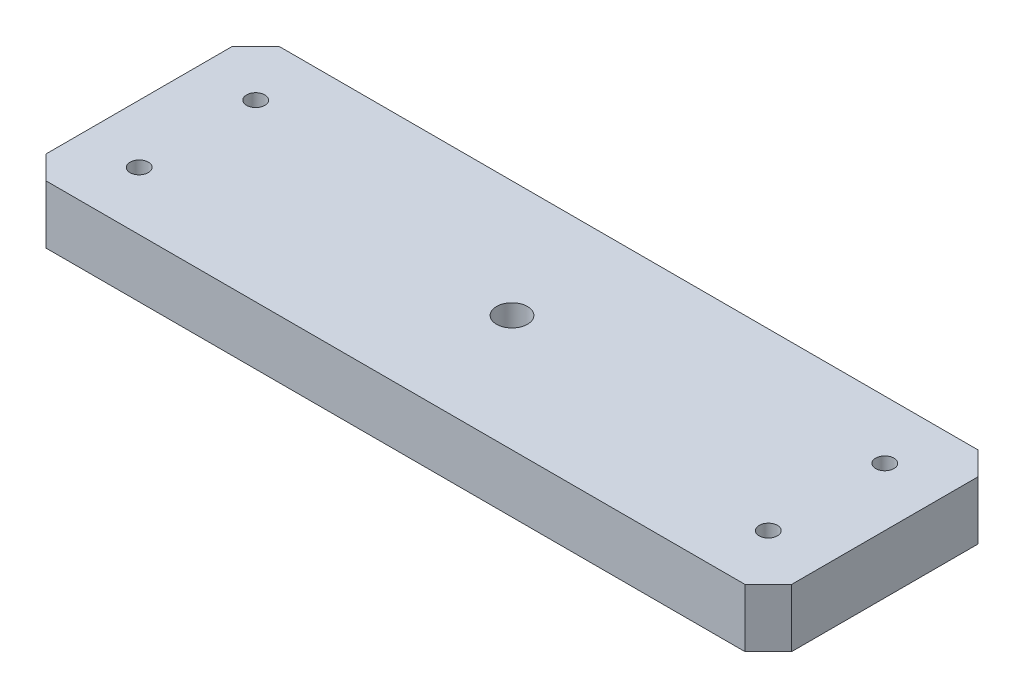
ISO-10303-21;
HEADER;
FILE_DESCRIPTION(('STEP AP214'),'2;1');
FILE_NAME('part.step','',(''),(''),'','','');
FILE_SCHEMA(('AUTOMOTIVE_DESIGN { 1 0 10303 214 1 1 1 1 }'));
ENDSEC;
DATA;
#1=APPLICATION_CONTEXT('core data for automotive mechanical design processes');
#2=APPLICATION_PROTOCOL_DEFINITION('international standard','automotive_design',2000,#1);
#3=PRODUCT_CONTEXT('',#1,'mechanical');
#4=PRODUCT('Part','Part','',(#3));
#5=PRODUCT_RELATED_PRODUCT_CATEGORY('part','',(#4));
#6=PRODUCT_DEFINITION_FORMATION('','',#4);
#7=PRODUCT_DEFINITION_CONTEXT('part definition',#1,'design');
#8=PRODUCT_DEFINITION('design','',#6,#7);
#9=PRODUCT_DEFINITION_SHAPE('','',#8);
#10=(LENGTH_UNIT() NAMED_UNIT(*) SI_UNIT(.MILLI.,.METRE.));
#11=(NAMED_UNIT(*) PLANE_ANGLE_UNIT() SI_UNIT($,.RADIAN.));
#12=(NAMED_UNIT(*) SI_UNIT($,.STERADIAN.) SOLID_ANGLE_UNIT());
#13=UNCERTAINTY_MEASURE_WITH_UNIT(LENGTH_MEASURE(1.E-05),#10,'distance_accuracy_value','');
#14=(GEOMETRIC_REPRESENTATION_CONTEXT(3) GLOBAL_UNCERTAINTY_ASSIGNED_CONTEXT((#13)) GLOBAL_UNIT_ASSIGNED_CONTEXT((#10,
#11,#12)) REPRESENTATION_CONTEXT('',''));
#15=CARTESIAN_POINT('',(0.,0.,0.));
#16=DIRECTION('',(0.,0.,1.));
#17=DIRECTION('',(1.,0.,0.));
#18=AXIS2_PLACEMENT_3D('',#15,#16,#17);
#19=CARTESIAN_POINT('',(101.6,15.875,-31.75));
#20=DIRECTION('',(-1.,0.,0.));
#21=DIRECTION('',(0.,0.,1.));
#22=AXIS2_PLACEMENT_3D('',#19,#20,#21);
#23=PLANE('',#22);
#24=DIRECTION('',(0.,0.,-1.));
#25=VECTOR('',#24,1.);
#26=CARTESIAN_POINT('',(101.6,15.875,-31.75));
#27=LINE('',#26,#25);
#28=CARTESIAN_POINT('',(101.6,15.875,25.4));
#29=VERTEX_POINT('',#28);
#30=CARTESIAN_POINT('',(101.6,15.875,-25.4));
#31=VERTEX_POINT('',#30);
#32=EDGE_CURVE('E118',#29,#31,#27,.T.);
#33=ORIENTED_EDGE('',*,*,#32,.F.);
#34=DIRECTION('',(0.,-1.,0.));
#35=VECTOR('',#34,1.);
#36=CARTESIAN_POINT('',(101.6,15.875,25.4));
#37=LINE('',#36,#35);
#38=CARTESIAN_POINT('',(101.6,0.,25.4));
#39=VERTEX_POINT('',#38);
#40=EDGE_CURVE('E103',#29,#39,#37,.T.);
#41=ORIENTED_EDGE('',*,*,#40,.T.);
#42=DIRECTION('',(0.,0.,-1.));
#43=VECTOR('',#42,1.);
#44=CARTESIAN_POINT('',(101.6,0.,-31.75));
#45=LINE('',#44,#43);
#46=CARTESIAN_POINT('',(101.6,0.,-25.4));
#47=VERTEX_POINT('',#46);
#48=EDGE_CURVE('E115',#39,#47,#45,.T.);
#49=ORIENTED_EDGE('',*,*,#48,.T.);
#50=DIRECTION('',(0.,1.,0.));
#51=VECTOR('',#50,1.);
#52=CARTESIAN_POINT('',(101.6,15.875,-25.4));
#53=LINE('',#52,#51);
#54=EDGE_CURVE('E120',#47,#31,#53,.T.);
#55=ORIENTED_EDGE('',*,*,#54,.T.);
#56=EDGE_LOOP('',(#33,#41,#49,#55));
#57=FACE_BOUND('',#56,.T.);
#58=ADVANCED_FACE('F33',(#57),#23,.F.);
#59=CARTESIAN_POINT('',(-101.6,15.875,-31.75));
#60=DIRECTION('',(0.,0.,1.));
#61=DIRECTION('',(1.,0.,0.));
#62=AXIS2_PLACEMENT_3D('',#59,#60,#61);
#63=PLANE('',#62);
#64=DIRECTION('',(-1.,0.,0.));
#65=VECTOR('',#64,1.);
#66=CARTESIAN_POINT('',(-101.6,15.875,-31.75));
#67=LINE('',#66,#65);
#68=CARTESIAN_POINT('',(95.25,15.875,-31.75));
#69=VERTEX_POINT('',#68);
#70=CARTESIAN_POINT('',(-95.25,15.875,-31.75));
#71=VERTEX_POINT('',#70);
#72=EDGE_CURVE('E164',#69,#71,#67,.T.);
#73=ORIENTED_EDGE('',*,*,#72,.F.);
#74=DIRECTION('',(0.,-1.,0.));
#75=VECTOR('',#74,1.);
#76=CARTESIAN_POINT('',(95.25,15.875,-31.75));
#77=LINE('',#76,#75);
#78=CARTESIAN_POINT('',(95.25,0.,-31.75));
#79=VERTEX_POINT('',#78);
#80=EDGE_CURVE('E157',#69,#79,#77,.T.);
#81=ORIENTED_EDGE('',*,*,#80,.T.);
#82=DIRECTION('',(-1.,0.,0.));
#83=VECTOR('',#82,1.);
#84=CARTESIAN_POINT('',(-101.6,0.,-31.75));
#85=LINE('',#84,#83);
#86=CARTESIAN_POINT('',(-95.25,0.,-31.75));
#87=VERTEX_POINT('',#86);
#88=EDGE_CURVE('E124',#79,#87,#85,.T.);
#89=ORIENTED_EDGE('',*,*,#88,.T.);
#90=DIRECTION('',(0.,1.,0.));
#91=VECTOR('',#90,1.);
#92=CARTESIAN_POINT('',(-95.25,15.875,-31.75));
#93=LINE('',#92,#91);
#94=EDGE_CURVE('E155',#87,#71,#93,.T.);
#95=ORIENTED_EDGE('',*,*,#94,.T.);
#96=EDGE_LOOP('',(#73,#81,#89,#95));
#97=FACE_BOUND('',#96,.T.);
#98=ADVANCED_FACE('F162',(#97),#63,.F.);
#99=CARTESIAN_POINT('',(-101.6,15.875,-31.75));
#100=DIRECTION('',(1.,0.,0.));
#101=DIRECTION('',(0.,0.,-1.));
#102=AXIS2_PLACEMENT_3D('',#99,#100,#101);
#103=PLANE('',#102);
#104=DIRECTION('',(0.,0.,1.));
#105=VECTOR('',#104,1.);
#106=CARTESIAN_POINT('',(-101.6,15.875,-31.75));
#107=LINE('',#106,#105);
#108=CARTESIAN_POINT('',(-101.6,15.875,-25.4));
#109=VERTEX_POINT('',#108);
#110=CARTESIAN_POINT('',(-101.6,15.875,25.3999999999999));
#111=VERTEX_POINT('',#110);
#112=EDGE_CURVE('E172',#109,#111,#107,.T.);
#113=ORIENTED_EDGE('',*,*,#112,.F.);
#114=DIRECTION('',(0.,-1.,0.));
#115=VECTOR('',#114,1.);
#116=CARTESIAN_POINT('',(-101.6,15.875,-25.4));
#117=LINE('',#116,#115);
#118=CARTESIAN_POINT('',(-101.6,0.,-25.4));
#119=VERTEX_POINT('',#118);
#120=EDGE_CURVE('E11',#109,#119,#117,.T.);
#121=ORIENTED_EDGE('',*,*,#120,.T.);
#122=DIRECTION('',(0.,0.,1.));
#123=VECTOR('',#122,1.);
#124=CARTESIAN_POINT('',(-101.6,0.,-31.75));
#125=LINE('',#124,#123);
#126=CARTESIAN_POINT('',(-101.6,0.,25.3999999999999));
#127=VERTEX_POINT('',#126);
#128=EDGE_CURVE('E128',#119,#127,#125,.T.);
#129=ORIENTED_EDGE('',*,*,#128,.T.);
#130=DIRECTION('',(0.,1.,0.));
#131=VECTOR('',#130,1.);
#132=CARTESIAN_POINT('',(-101.6,15.875,25.3999999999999));
#133=LINE('',#132,#131);
#134=EDGE_CURVE('E41',#127,#111,#133,.T.);
#135=ORIENTED_EDGE('',*,*,#134,.T.);
#136=EDGE_LOOP('',(#113,#121,#129,#135));
#137=FACE_BOUND('',#136,.T.);
#138=ADVANCED_FACE('F171',(#137),#103,.F.);
#139=CARTESIAN_POINT('',(-101.6,15.875,31.75));
#140=DIRECTION('',(0.,0.,-1.));
#141=DIRECTION('',(-1.,0.,0.));
#142=AXIS2_PLACEMENT_3D('',#139,#140,#141);
#143=PLANE('',#142);
#144=DIRECTION('',(1.,0.,0.));
#145=VECTOR('',#144,1.);
#146=CARTESIAN_POINT('',(-101.6,0.,31.75));
#147=LINE('',#146,#145);
#148=CARTESIAN_POINT('',(-95.25,0.,31.75));
#149=VERTEX_POINT('',#148);
#150=CARTESIAN_POINT('',(95.25,0.,31.75));
#151=VERTEX_POINT('',#150);
#152=EDGE_CURVE('E138',#149,#151,#147,.T.);
#153=ORIENTED_EDGE('',*,*,#152,.T.);
#154=DIRECTION('',(0.,1.,0.));
#155=VECTOR('',#154,1.);
#156=CARTESIAN_POINT('',(95.25,15.875,31.75));
#157=LINE('',#156,#155);
#158=CARTESIAN_POINT('',(95.2499999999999,15.875,31.75));
#159=VERTEX_POINT('',#158);
#160=EDGE_CURVE('E104',#151,#159,#157,.T.);
#161=ORIENTED_EDGE('',*,*,#160,.T.);
#162=DIRECTION('',(1.,0.,0.));
#163=VECTOR('',#162,1.);
#164=CARTESIAN_POINT('',(-101.6,15.875,31.75));
#165=LINE('',#164,#163);
#166=CARTESIAN_POINT('',(-95.25,15.875,31.75));
#167=VERTEX_POINT('',#166);
#168=EDGE_CURVE('E134',#167,#159,#165,.T.);
#169=ORIENTED_EDGE('',*,*,#168,.F.);
#170=DIRECTION('',(0.,-1.,0.));
#171=VECTOR('',#170,1.);
#172=CARTESIAN_POINT('',(-95.25,15.875,31.75));
#173=LINE('',#172,#171);
#174=EDGE_CURVE('E109',#167,#149,#173,.T.);
#175=ORIENTED_EDGE('',*,*,#174,.T.);
#176=EDGE_LOOP('',(#153,#161,#169,#175));
#177=FACE_BOUND('',#176,.T.);
#178=ADVANCED_FACE('F233',(#177),#143,.F.);
#179=CARTESIAN_POINT('',(0.,15.875,0.));
#180=DIRECTION('',(0.,1.,0.));
#181=DIRECTION('',(0.,0.,1.));
#182=AXIS2_PLACEMENT_3D('',#179,#180,#181);
#183=PLANE('',#182);
#184=CARTESIAN_POINT('',(0.,15.875,0.));
#185=DIRECTION('',(0.,-1.,0.));
#186=DIRECTION('',(0.,0.,-1.));
#187=AXIS2_PLACEMENT_3D('',#184,#185,#186);
#188=CIRCLE('',#187,4.2164);
#189=CARTESIAN_POINT('',(0.,15.875,-4.2164));
#190=VERTEX_POINT('',#189);
#191=EDGE_CURVE('E198',#190,#190,#188,.T.);
#192=ORIENTED_EDGE('',*,*,#191,.T.);
#193=EDGE_LOOP('',(#192));
#194=FACE_BOUND('',#193,.T.);
#195=CARTESIAN_POINT('',(-85.725,15.875,-15.875));
#196=DIRECTION('',(0.,1.,0.));
#197=DIRECTION('',(0.,0.,1.));
#198=AXIS2_PLACEMENT_3D('',#195,#196,#197);
#199=CIRCLE('',#198,2.48919999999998);
#200=CARTESIAN_POINT('',(-85.725,15.875,-13.3858));
#201=VERTEX_POINT('',#200);
#202=EDGE_CURVE('E195',#201,#201,#199,.T.);
#203=ORIENTED_EDGE('',*,*,#202,.F.);
#204=EDGE_LOOP('',(#203));
#205=FACE_BOUND('',#204,.T.);
#206=CARTESIAN_POINT('',(85.725,15.875,-15.875));
#207=DIRECTION('',(0.,1.,0.));
#208=DIRECTION('',(0.,0.,1.));
#209=AXIS2_PLACEMENT_3D('',#206,#207,#208);
#210=CIRCLE('',#209,2.48919999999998);
#211=CARTESIAN_POINT('',(85.725,15.875,-13.3858));
#212=VERTEX_POINT('',#211);
#213=EDGE_CURVE('E189',#212,#212,#210,.T.);
#214=ORIENTED_EDGE('',*,*,#213,.F.);
#215=EDGE_LOOP('',(#214));
#216=FACE_BOUND('',#215,.T.);
#217=CARTESIAN_POINT('',(85.725,15.875,15.875));
#218=DIRECTION('',(0.,1.,0.));
#219=DIRECTION('',(0.,0.,1.));
#220=AXIS2_PLACEMENT_3D('',#217,#218,#219);
#221=CIRCLE('',#220,2.48919999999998);
#222=CARTESIAN_POINT('',(85.725,15.875,18.3642));
#223=VERTEX_POINT('',#222);
#224=EDGE_CURVE('E183',#223,#223,#221,.T.);
#225=ORIENTED_EDGE('',*,*,#224,.F.);
#226=EDGE_LOOP('',(#225));
#227=FACE_BOUND('',#226,.T.);
#228=CARTESIAN_POINT('',(-85.725,15.875,15.875));
#229=DIRECTION('',(0.,1.,0.));
#230=DIRECTION('',(0.,0.,1.));
#231=AXIS2_PLACEMENT_3D('',#228,#229,#230);
#232=CIRCLE('',#231,2.48919999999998);
#233=CARTESIAN_POINT('',(-85.725,15.875,18.3642));
#234=VERTEX_POINT('',#233);
#235=EDGE_CURVE('E131',#234,#234,#232,.T.);
#236=ORIENTED_EDGE('',*,*,#235,.F.);
#237=EDGE_LOOP('',(#236));
#238=FACE_BOUND('',#237,.T.);
#239=ORIENTED_EDGE('',*,*,#168,.T.);
#240=DIRECTION('',(-0.707106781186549,0.,0.707106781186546));
#241=VECTOR('',#240,1.);
#242=CARTESIAN_POINT('',(63.4999999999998,15.875,63.5));
#243=LINE('',#242,#241);
#244=EDGE_CURVE('E153',#159,#29,#243,.F.);
#245=ORIENTED_EDGE('',*,*,#244,.T.);
#246=ORIENTED_EDGE('',*,*,#32,.T.);
#247=DIRECTION('',(0.707106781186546,0.,0.707106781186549));
#248=VECTOR('',#247,1.);
#249=CARTESIAN_POINT('',(63.5000000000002,15.875,-63.4999999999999));
#250=LINE('',#249,#248);
#251=EDGE_CURVE('E151',#31,#69,#250,.F.);
#252=ORIENTED_EDGE('',*,*,#251,.T.);
#253=ORIENTED_EDGE('',*,*,#72,.T.);
#254=DIRECTION('',(0.707106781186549,0.,-0.707106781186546));
#255=VECTOR('',#254,1.);
#256=CARTESIAN_POINT('',(-63.4999999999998,15.875,-63.5000000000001));
#257=LINE('',#256,#255);
#258=EDGE_CURVE('E54',#71,#109,#257,.F.);
#259=ORIENTED_EDGE('',*,*,#258,.T.);
#260=ORIENTED_EDGE('',*,*,#112,.T.);
#261=DIRECTION('',(-0.707106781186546,0.,-0.707106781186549));
#262=VECTOR('',#261,1.);
#263=CARTESIAN_POINT('',(-63.5000000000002,15.875,63.4999999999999));
#264=LINE('',#263,#262);
#265=EDGE_CURVE('E148',#111,#167,#264,.F.);
#266=ORIENTED_EDGE('',*,*,#265,.T.);
#267=EDGE_LOOP('',(#239,#245,#246,#252,#253,#259,#260,#266));
#268=FACE_BOUND('',#267,.T.);
#269=ADVANCED_FACE('F216',(#194,#205,#216,#227,#238,#268),#183,.T.);
#270=CARTESIAN_POINT('',(0.,0.,0.));
#271=DIRECTION('',(0.,1.,0.));
#272=DIRECTION('',(0.,0.,1.));
#273=AXIS2_PLACEMENT_3D('',#270,#271,#272);
#274=PLANE('',#273);
#275=CARTESIAN_POINT('',(0.,0.,0.));
#276=DIRECTION('',(0.,-1.,0.));
#277=DIRECTION('',(0.,0.,-1.));
#278=AXIS2_PLACEMENT_3D('',#275,#276,#277);
#279=CIRCLE('',#278,6.74751);
#280=CARTESIAN_POINT('',(0.,0.,-6.74751));
#281=VERTEX_POINT('',#280);
#282=EDGE_CURVE('E207',#281,#281,#279,.T.);
#283=ORIENTED_EDGE('',*,*,#282,.F.);
#284=EDGE_LOOP('',(#283));
#285=FACE_BOUND('',#284,.T.);
#286=CARTESIAN_POINT('',(-85.725,0.,-15.875));
#287=DIRECTION('',(0.,1.,0.));
#288=DIRECTION('',(0.,0.,1.));
#289=AXIS2_PLACEMENT_3D('',#286,#287,#288);
#290=CIRCLE('',#289,2.4892);
#291=CARTESIAN_POINT('',(-85.725,0.,-13.3858));
#292=VERTEX_POINT('',#291);
#293=EDGE_CURVE('E192',#292,#292,#290,.T.);
#294=ORIENTED_EDGE('',*,*,#293,.T.);
#295=EDGE_LOOP('',(#294));
#296=FACE_BOUND('',#295,.T.);
#297=CARTESIAN_POINT('',(85.725,0.,-15.875));
#298=DIRECTION('',(0.,1.,0.));
#299=DIRECTION('',(0.,0.,1.));
#300=AXIS2_PLACEMENT_3D('',#297,#298,#299);
#301=CIRCLE('',#300,2.4892);
#302=CARTESIAN_POINT('',(85.725,0.,-13.3858));
#303=VERTEX_POINT('',#302);
#304=EDGE_CURVE('E186',#303,#303,#301,.T.);
#305=ORIENTED_EDGE('',*,*,#304,.T.);
#306=EDGE_LOOP('',(#305));
#307=FACE_BOUND('',#306,.T.);
#308=CARTESIAN_POINT('',(85.725,0.,15.875));
#309=DIRECTION('',(0.,1.,0.));
#310=DIRECTION('',(0.,0.,1.));
#311=AXIS2_PLACEMENT_3D('',#308,#309,#310);
#312=CIRCLE('',#311,2.4892);
#313=CARTESIAN_POINT('',(85.725,0.,18.3642));
#314=VERTEX_POINT('',#313);
#315=EDGE_CURVE('E180',#314,#314,#312,.T.);
#316=ORIENTED_EDGE('',*,*,#315,.T.);
#317=EDGE_LOOP('',(#316));
#318=FACE_BOUND('',#317,.T.);
#319=CARTESIAN_POINT('',(-85.725,0.,15.875));
#320=DIRECTION('',(0.,1.,0.));
#321=DIRECTION('',(0.,0.,1.));
#322=AXIS2_PLACEMENT_3D('',#319,#320,#321);
#323=CIRCLE('',#322,2.4892);
#324=CARTESIAN_POINT('',(-85.725,0.,18.3642));
#325=VERTEX_POINT('',#324);
#326=EDGE_CURVE('E125',#325,#325,#323,.T.);
#327=ORIENTED_EDGE('',*,*,#326,.T.);
#328=EDGE_LOOP('',(#327));
#329=FACE_BOUND('',#328,.T.);
#330=ORIENTED_EDGE('',*,*,#48,.F.);
#331=DIRECTION('',(0.707106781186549,0.,-0.707106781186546));
#332=VECTOR('',#331,1.);
#333=CARTESIAN_POINT('',(101.6,0.,25.4));
#334=LINE('',#333,#332);
#335=EDGE_CURVE('E99',#39,#151,#334,.F.);
#336=ORIENTED_EDGE('',*,*,#335,.T.);
#337=ORIENTED_EDGE('',*,*,#152,.F.);
#338=DIRECTION('',(0.707106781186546,0.,0.707106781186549));
#339=VECTOR('',#338,1.);
#340=CARTESIAN_POINT('',(-95.25,0.,31.75));
#341=LINE('',#340,#339);
#342=EDGE_CURVE('E119',#149,#127,#341,.F.);
#343=ORIENTED_EDGE('',*,*,#342,.T.);
#344=ORIENTED_EDGE('',*,*,#128,.F.);
#345=DIRECTION('',(-0.707106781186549,0.,0.707106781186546));
#346=VECTOR('',#345,1.);
#347=CARTESIAN_POINT('',(-101.6,0.,-25.4));
#348=LINE('',#347,#346);
#349=EDGE_CURVE('E142',#119,#87,#348,.F.);
#350=ORIENTED_EDGE('',*,*,#349,.T.);
#351=ORIENTED_EDGE('',*,*,#88,.F.);
#352=DIRECTION('',(-0.707106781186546,0.,-0.707106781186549));
#353=VECTOR('',#352,1.);
#354=CARTESIAN_POINT('',(95.25,0.,-31.75));
#355=LINE('',#354,#353);
#356=EDGE_CURVE('E110',#79,#47,#355,.F.);
#357=ORIENTED_EDGE('',*,*,#356,.T.);
#358=EDGE_LOOP('',(#330,#336,#337,#343,#344,#350,#351,#357));
#359=FACE_BOUND('',#358,.T.);
#360=ADVANCED_FACE('F122',(#285,#296,#307,#318,#329,#359),#274,.F.);
#361=CARTESIAN_POINT('',(-85.725,15.875,15.875));
#362=DIRECTION('',(0.,1.,0.));
#363=DIRECTION('',(0.,0.,1.));
#364=AXIS2_PLACEMENT_3D('',#361,#362,#363);
#365=CYLINDRICAL_SURFACE('',#364,2.48919999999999);
#366=ORIENTED_EDGE('',*,*,#326,.F.);
#367=EDGE_LOOP('',(#366));
#368=FACE_BOUND('',#367,.T.);
#369=ORIENTED_EDGE('',*,*,#235,.T.);
#370=EDGE_LOOP('',(#369));
#371=FACE_BOUND('',#370,.T.);
#372=ADVANCED_FACE('F215',(#368,#371),#365,.F.);
#373=CARTESIAN_POINT('',(85.725,15.875,15.875));
#374=DIRECTION('',(0.,1.,0.));
#375=DIRECTION('',(0.,0.,1.));
#376=AXIS2_PLACEMENT_3D('',#373,#374,#375);
#377=CYLINDRICAL_SURFACE('',#376,2.48919999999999);
#378=ORIENTED_EDGE('',*,*,#315,.F.);
#379=EDGE_LOOP('',(#378));
#380=FACE_BOUND('',#379,.T.);
#381=ORIENTED_EDGE('',*,*,#224,.T.);
#382=EDGE_LOOP('',(#381));
#383=FACE_BOUND('',#382,.T.);
#384=ADVANCED_FACE('F228',(#380,#383),#377,.F.);
#385=CARTESIAN_POINT('',(85.725,15.875,-15.875));
#386=DIRECTION('',(0.,1.,0.));
#387=DIRECTION('',(0.,0.,1.));
#388=AXIS2_PLACEMENT_3D('',#385,#386,#387);
#389=CYLINDRICAL_SURFACE('',#388,2.48919999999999);
#390=ORIENTED_EDGE('',*,*,#304,.F.);
#391=EDGE_LOOP('',(#390));
#392=FACE_BOUND('',#391,.T.);
#393=ORIENTED_EDGE('',*,*,#213,.T.);
#394=EDGE_LOOP('',(#393));
#395=FACE_BOUND('',#394,.T.);
#396=ADVANCED_FACE('F315',(#392,#395),#389,.F.);
#397=CARTESIAN_POINT('',(-85.725,15.875,-15.875));
#398=DIRECTION('',(0.,1.,0.));
#399=DIRECTION('',(0.,0.,1.));
#400=AXIS2_PLACEMENT_3D('',#397,#398,#399);
#401=CYLINDRICAL_SURFACE('',#400,2.48919999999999);
#402=ORIENTED_EDGE('',*,*,#293,.F.);
#403=EDGE_LOOP('',(#402));
#404=FACE_BOUND('',#403,.T.);
#405=ORIENTED_EDGE('',*,*,#202,.T.);
#406=EDGE_LOOP('',(#405));
#407=FACE_BOUND('',#406,.T.);
#408=ADVANCED_FACE('F260',(#404,#407),#401,.F.);
#409=CARTESIAN_POINT('',(101.6,15.875,25.4));
#410=DIRECTION('',(-0.707106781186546,0.,-0.707106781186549));
#411=DIRECTION('',(0.,-1.,0.));
#412=AXIS2_PLACEMENT_3D('',#409,#410,#411);
#413=PLANE('',#412);
#414=ORIENTED_EDGE('',*,*,#244,.F.);
#415=ORIENTED_EDGE('',*,*,#160,.F.);
#416=ORIENTED_EDGE('',*,*,#335,.F.);
#417=ORIENTED_EDGE('',*,*,#40,.F.);
#418=EDGE_LOOP('',(#414,#415,#416,#417));
#419=FACE_BOUND('',#418,.T.);
#420=ADVANCED_FACE('F102',(#419),#413,.F.);
#421=CARTESIAN_POINT('',(95.25,15.875,-31.75));
#422=DIRECTION('',(-0.707106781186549,0.,0.707106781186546));
#423=DIRECTION('',(0.,-1.,0.));
#424=AXIS2_PLACEMENT_3D('',#421,#422,#423);
#425=PLANE('',#424);
#426=ORIENTED_EDGE('',*,*,#251,.F.);
#427=ORIENTED_EDGE('',*,*,#54,.F.);
#428=ORIENTED_EDGE('',*,*,#356,.F.);
#429=ORIENTED_EDGE('',*,*,#80,.F.);
#430=EDGE_LOOP('',(#426,#427,#428,#429));
#431=FACE_BOUND('',#430,.T.);
#432=ADVANCED_FACE('F249',(#431),#425,.F.);
#433=CARTESIAN_POINT('',(-101.6,15.875,-25.4));
#434=DIRECTION('',(0.707106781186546,0.,0.707106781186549));
#435=DIRECTION('',(0.,-1.,0.));
#436=AXIS2_PLACEMENT_3D('',#433,#434,#435);
#437=PLANE('',#436);
#438=ORIENTED_EDGE('',*,*,#258,.F.);
#439=ORIENTED_EDGE('',*,*,#94,.F.);
#440=ORIENTED_EDGE('',*,*,#349,.F.);
#441=ORIENTED_EDGE('',*,*,#120,.F.);
#442=EDGE_LOOP('',(#438,#439,#440,#441));
#443=FACE_BOUND('',#442,.T.);
#444=ADVANCED_FACE('F170',(#443),#437,.F.);
#445=CARTESIAN_POINT('',(-95.25,15.875,31.75));
#446=DIRECTION('',(0.707106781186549,0.,-0.707106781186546));
#447=DIRECTION('',(0.,-1.,0.));
#448=AXIS2_PLACEMENT_3D('',#445,#446,#447);
#449=PLANE('',#448);
#450=ORIENTED_EDGE('',*,*,#265,.F.);
#451=ORIENTED_EDGE('',*,*,#134,.F.);
#452=ORIENTED_EDGE('',*,*,#342,.F.);
#453=ORIENTED_EDGE('',*,*,#174,.F.);
#454=EDGE_LOOP('',(#450,#451,#452,#453));
#455=FACE_BOUND('',#454,.T.);
#456=ADVANCED_FACE('F35',(#455),#449,.F.);
#457=CARTESIAN_POINT('',(0.,0.,0.));
#458=DIRECTION('',(0.,-1.,0.));
#459=DIRECTION('',(0.,0.,-1.));
#460=AXIS2_PLACEMENT_3D('',#457,#458,#459);
#461=CYLINDRICAL_SURFACE('',#460,4.2164);
#462=ORIENTED_EDGE('',*,*,#191,.F.);
#463=EDGE_LOOP('',(#462));
#464=FACE_BOUND('',#463,.T.);
#465=CARTESIAN_POINT('',(0.,7.9375,0.));
#466=DIRECTION('',(0.,-1.,0.));
#467=DIRECTION('',(0.,0.,-1.));
#468=AXIS2_PLACEMENT_3D('',#465,#466,#467);
#469=CIRCLE('',#468,4.2164);
#470=CARTESIAN_POINT('',(0.,7.9375,-4.2164));
#471=VERTEX_POINT('',#470);
#472=EDGE_CURVE('E201',#471,#471,#469,.T.);
#473=ORIENTED_EDGE('',*,*,#472,.T.);
#474=EDGE_LOOP('',(#473));
#475=FACE_BOUND('',#474,.T.);
#476=ADVANCED_FACE('F241',(#464,#475),#461,.F.);
#477=CARTESIAN_POINT('',(4.2164,7.9375,0.));
#478=DIRECTION('',(0.,1.,0.));
#479=DIRECTION('',(0.,0.,1.));
#480=AXIS2_PLACEMENT_3D('',#477,#478,#479);
#481=PLANE('',#480);
#482=ORIENTED_EDGE('',*,*,#472,.F.);
#483=EDGE_LOOP('',(#482));
#484=FACE_BOUND('',#483,.T.);
#485=CARTESIAN_POINT('',(0.,7.9375,0.));
#486=DIRECTION('',(0.,-1.,0.));
#487=DIRECTION('',(0.,0.,-1.));
#488=AXIS2_PLACEMENT_3D('',#485,#486,#487);
#489=CIRCLE('',#488,6.74751);
#490=CARTESIAN_POINT('',(0.,7.9375,-6.74751));
#491=VERTEX_POINT('',#490);
#492=EDGE_CURVE('E204',#491,#491,#489,.T.);
#493=ORIENTED_EDGE('',*,*,#492,.T.);
#494=EDGE_LOOP('',(#493));
#495=FACE_BOUND('',#494,.T.);
#496=ADVANCED_FACE('F246',(#484,#495),#481,.F.);
#497=CARTESIAN_POINT('',(0.,0.,0.));
#498=DIRECTION('',(0.,-1.,0.));
#499=DIRECTION('',(0.,0.,-1.));
#500=AXIS2_PLACEMENT_3D('',#497,#498,#499);
#501=CYLINDRICAL_SURFACE('',#500,6.74751);
#502=ORIENTED_EDGE('',*,*,#492,.F.);
#503=EDGE_LOOP('',(#502));
#504=FACE_BOUND('',#503,.T.);
#505=ORIENTED_EDGE('',*,*,#282,.T.);
#506=EDGE_LOOP('',(#505));
#507=FACE_BOUND('',#506,.T.);
#508=ADVANCED_FACE('F211',(#504,#507),#501,.F.);
#509=CLOSED_SHELL('',(#58,#98,#138,#178,#269,#360,#372,#384,#396,#408,#420,#432,#444,#456,#476,
#496,#508));
#510=MANIFOLD_SOLID_BREP('B2',#509);
#511=ADVANCED_BREP_SHAPE_REPRESENTATION('',(#18,#510),#14);
#512=SHAPE_DEFINITION_REPRESENTATION(#9,#511);
ENDSEC;
END-ISO-10303-21;
